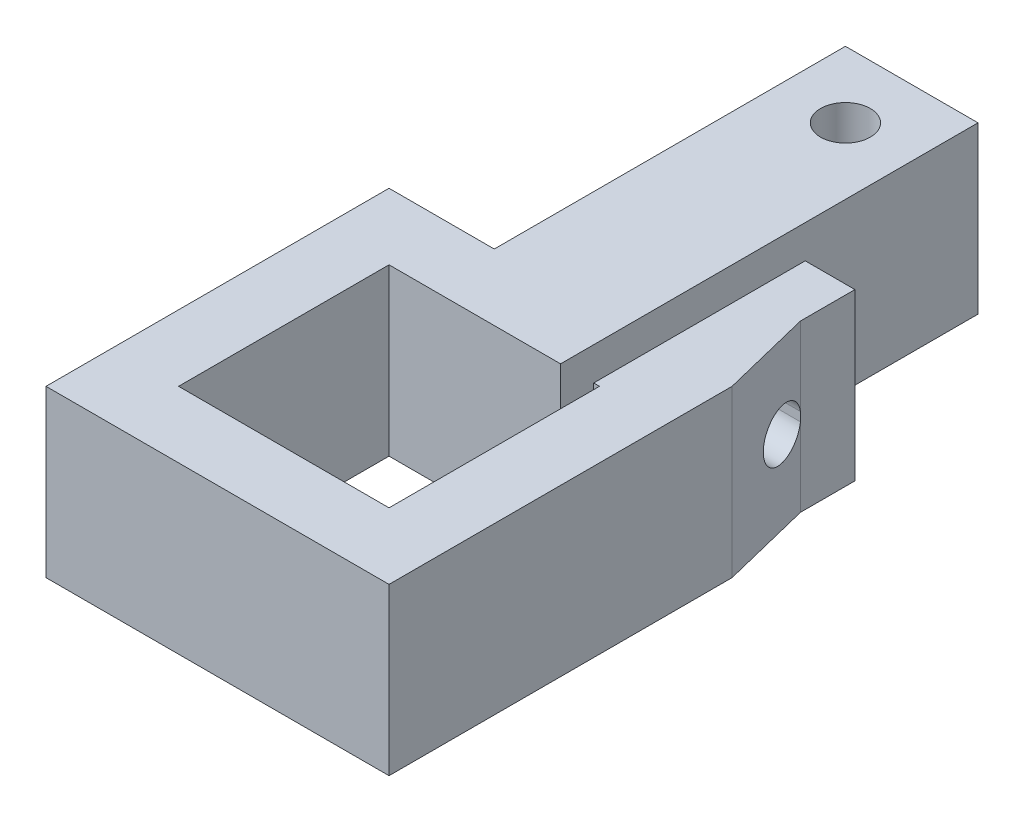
ISO-10303-21;
HEADER;
FILE_DESCRIPTION(('STEP AP214'),'2;1');
FILE_NAME('part.step','',(''),(''),'','','');
FILE_SCHEMA(('AUTOMOTIVE_DESIGN { 1 0 10303 214 1 1 1 1 }'));
ENDSEC;
DATA;
#1=APPLICATION_CONTEXT('core data for automotive mechanical design processes');
#2=APPLICATION_PROTOCOL_DEFINITION('international standard','automotive_design',2000,#1);
#3=PRODUCT_CONTEXT('',#1,'mechanical');
#4=PRODUCT('Part','Part','',(#3));
#5=PRODUCT_RELATED_PRODUCT_CATEGORY('part','',(#4));
#6=PRODUCT_DEFINITION_FORMATION('','',#4);
#7=PRODUCT_DEFINITION_CONTEXT('part definition',#1,'design');
#8=PRODUCT_DEFINITION('design','',#6,#7);
#9=PRODUCT_DEFINITION_SHAPE('','',#8);
#10=(LENGTH_UNIT() NAMED_UNIT(*) SI_UNIT(.MILLI.,.METRE.));
#11=(NAMED_UNIT(*) PLANE_ANGLE_UNIT() SI_UNIT($,.RADIAN.));
#12=(NAMED_UNIT(*) SI_UNIT($,.STERADIAN.) SOLID_ANGLE_UNIT());
#13=UNCERTAINTY_MEASURE_WITH_UNIT(LENGTH_MEASURE(1.E-05),#10,'distance_accuracy_value','');
#14=(GEOMETRIC_REPRESENTATION_CONTEXT(3) GLOBAL_UNCERTAINTY_ASSIGNED_CONTEXT((#13)) GLOBAL_UNIT_ASSIGNED_CONTEXT((#10,
#11,#12)) REPRESENTATION_CONTEXT('',''));
#15=CARTESIAN_POINT('',(0.,0.,0.));
#16=DIRECTION('',(0.,0.,1.));
#17=DIRECTION('',(1.,0.,0.));
#18=AXIS2_PLACEMENT_3D('',#15,#16,#17);
#19=CARTESIAN_POINT('',(1.,10.,0.));
#20=DIRECTION('',(-1.,0.,0.));
#21=DIRECTION('',(0.,0.,1.));
#22=AXIS2_PLACEMENT_3D('',#19,#20,#21);
#23=PLANE('',#22);
#24=DIRECTION('',(0.,0.,-1.));
#25=VECTOR('',#24,1.);
#26=CARTESIAN_POINT('',(1.,0.,0.));
#27=LINE('',#26,#25);
#28=CARTESIAN_POINT('',(1.,0.,-5.88729425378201));
#29=VERTEX_POINT('',#28);
#30=CARTESIAN_POINT('',(1.,0.,-18.6508880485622));
#31=VERTEX_POINT('',#30);
#32=EDGE_CURVE('E252',#29,#31,#27,.T.);
#33=ORIENTED_EDGE('',*,*,#32,.F.);
#34=DIRECTION('',(0.,-1.,0.));
#35=VECTOR('',#34,1.);
#36=CARTESIAN_POINT('',(1.,10.,-5.88729425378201));
#37=LINE('',#36,#35);
#38=CARTESIAN_POINT('',(1.,10.,-5.88729425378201));
#39=VERTEX_POINT('',#38);
#40=EDGE_CURVE('E11',#39,#29,#37,.T.);
#41=ORIENTED_EDGE('',*,*,#40,.F.);
#42=DIRECTION('',(0.,0.,-1.));
#43=VECTOR('',#42,1.);
#44=CARTESIAN_POINT('',(1.,10.,0.));
#45=LINE('',#44,#43);
#46=CARTESIAN_POINT('',(1.,10.,-18.6508880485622));
#47=VERTEX_POINT('',#46);
#48=EDGE_CURVE('E214',#39,#47,#45,.T.);
#49=ORIENTED_EDGE('',*,*,#48,.T.);
#50=DIRECTION('',(0.,-1.,0.));
#51=VECTOR('',#50,1.);
#52=CARTESIAN_POINT('',(1.,10.,-18.6508880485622));
#53=LINE('',#52,#51);
#54=EDGE_CURVE('E204',#47,#31,#53,.T.);
#55=ORIENTED_EDGE('',*,*,#54,.T.);
#56=EDGE_LOOP('',(#33,#41,#49,#55));
#57=FACE_BOUND('',#56,.T.);
#58=DIRECTION('',(0.,-1.,0.));
#59=VECTOR('',#58,1.);
#60=CARTESIAN_POINT('',(1.,10.,-15.3628000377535));
#61=LINE('',#60,#59);
#62=CARTESIAN_POINT('',(1.,5.26996792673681,-15.3628000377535));
#63=VERTEX_POINT('',#62);
#64=CARTESIAN_POINT('',(1.,4.73003207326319,-15.3628000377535));
#65=VERTEX_POINT('',#64);
#66=EDGE_CURVE('E255',#63,#65,#61,.T.);
#67=ORIENTED_EDGE('',*,*,#66,.F.);
#68=CARTESIAN_POINT('',(1.,5.,-13.887294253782));
#69=DIRECTION('',(-1.,0.,0.));
#70=DIRECTION('',(0.,0.,1.));
#71=AXIS2_PLACEMENT_3D('',#68,#69,#70);
#72=CIRCLE('',#71,1.5);
#73=EDGE_CURVE('E185',#63,#65,#72,.F.);
#74=ORIENTED_EDGE('',*,*,#73,.T.);
#75=EDGE_LOOP('',(#67,#74));
#76=FACE_BOUND('',#75,.T.);
#77=ADVANCED_FACE('F35',(#57,#76),#23,.T.);
#78=CARTESIAN_POINT('',(-0.999999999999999,10.,0.));
#79=DIRECTION('',(1.,0.,0.));
#80=DIRECTION('',(0.,0.,-1.));
#81=AXIS2_PLACEMENT_3D('',#78,#79,#80);
#82=PLANE('',#81);
#83=DIRECTION('',(0.,0.,1.));
#84=VECTOR('',#83,1.);
#85=CARTESIAN_POINT('',(-0.999999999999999,0.,0.));
#86=LINE('',#85,#84);
#87=CARTESIAN_POINT('',(-1.,0.,-31.077294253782));
#88=VERTEX_POINT('',#87);
#89=CARTESIAN_POINT('',(-1.,0.,-5.88729425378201));
#90=VERTEX_POINT('',#89);
#91=EDGE_CURVE('E237',#88,#90,#86,.T.);
#92=ORIENTED_EDGE('',*,*,#91,.F.);
#93=DIRECTION('',(0.,-1.,0.));
#94=VECTOR('',#93,1.);
#95=CARTESIAN_POINT('',(-1.,10.,-31.077294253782));
#96=LINE('',#95,#94);
#97=CARTESIAN_POINT('',(-1.,10.,-31.077294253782));
#98=VERTEX_POINT('',#97);
#99=EDGE_CURVE('E363',#98,#88,#96,.T.);
#100=ORIENTED_EDGE('',*,*,#99,.F.);
#101=DIRECTION('',(0.,0.,1.));
#102=VECTOR('',#101,1.);
#103=CARTESIAN_POINT('',(-0.999999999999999,10.,0.));
#104=LINE('',#103,#102);
#105=CARTESIAN_POINT('',(-1.,10.,-5.88729425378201));
#106=VERTEX_POINT('',#105);
#107=EDGE_CURVE('E274',#98,#106,#104,.T.);
#108=ORIENTED_EDGE('',*,*,#107,.T.);
#109=DIRECTION('',(0.,-1.,0.));
#110=VECTOR('',#109,1.);
#111=CARTESIAN_POINT('',(-1.,10.,-5.88729425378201));
#112=LINE('',#111,#110);
#113=EDGE_CURVE('E358',#106,#90,#112,.T.);
#114=ORIENTED_EDGE('',*,*,#113,.T.);
#115=EDGE_LOOP('',(#92,#100,#108,#114));
#116=FACE_BOUND('',#115,.T.);
#117=DIRECTION('',(0.,1.,0.));
#118=VECTOR('',#117,1.);
#119=CARTESIAN_POINT('',(-1.,10.,-15.3628000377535));
#120=LINE('',#119,#118);
#121=CARTESIAN_POINT('',(-1.,4.73003207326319,-15.3628000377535));
#122=VERTEX_POINT('',#121);
#123=CARTESIAN_POINT('',(-1.,5.26996792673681,-15.3628000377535));
#124=VERTEX_POINT('',#123);
#125=EDGE_CURVE('E291',#122,#124,#120,.T.);
#126=ORIENTED_EDGE('',*,*,#125,.F.);
#127=CARTESIAN_POINT('',(-1.,5.,-13.887294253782));
#128=DIRECTION('',(1.,0.,0.));
#129=DIRECTION('',(0.,0.,-1.));
#130=AXIS2_PLACEMENT_3D('',#127,#128,#129);
#131=CIRCLE('',#130,1.5);
#132=EDGE_CURVE('E297',#122,#124,#131,.F.);
#133=ORIENTED_EDGE('',*,*,#132,.T.);
#134=EDGE_LOOP('',(#126,#133));
#135=FACE_BOUND('',#134,.T.);
#136=ADVANCED_FACE('F365',(#116,#135),#82,.T.);
#137=CARTESIAN_POINT('',(-9.00000000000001,10.,0.));
#138=DIRECTION('',(1.,0.,0.));
#139=DIRECTION('',(0.,0.,-1.));
#140=AXIS2_PLACEMENT_3D('',#137,#138,#139);
#141=PLANE('',#140);
#142=DIRECTION('',(0.,0.,1.));
#143=VECTOR('',#142,1.);
#144=CARTESIAN_POINT('',(-9.00000000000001,0.,0.));
#145=LINE('',#144,#143);
#146=CARTESIAN_POINT('',(-9.,0.,-31.077294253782));
#147=VERTEX_POINT('',#146);
#148=CARTESIAN_POINT('',(-9.,0.,-9.88729425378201));
#149=VERTEX_POINT('',#148);
#150=EDGE_CURVE('E232',#147,#149,#145,.T.);
#151=ORIENTED_EDGE('',*,*,#150,.T.);
#152=DIRECTION('',(0.,-1.,0.));
#153=VECTOR('',#152,1.);
#154=CARTESIAN_POINT('',(-9.,10.,-9.88729425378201));
#155=LINE('',#154,#153);
#156=CARTESIAN_POINT('',(-9.,10.,-9.88729425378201));
#157=VERTEX_POINT('',#156);
#158=EDGE_CURVE('E379',#157,#149,#155,.T.);
#159=ORIENTED_EDGE('',*,*,#158,.F.);
#160=DIRECTION('',(0.,0.,1.));
#161=VECTOR('',#160,1.);
#162=CARTESIAN_POINT('',(-9.00000000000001,10.,0.));
#163=LINE('',#162,#161);
#164=CARTESIAN_POINT('',(-9.,10.,-31.077294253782));
#165=VERTEX_POINT('',#164);
#166=EDGE_CURVE('E270',#165,#157,#163,.T.);
#167=ORIENTED_EDGE('',*,*,#166,.F.);
#168=DIRECTION('',(0.,-1.,0.));
#169=VECTOR('',#168,1.);
#170=CARTESIAN_POINT('',(-9.,10.,-31.077294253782));
#171=LINE('',#170,#169);
#172=EDGE_CURVE('E370',#165,#147,#171,.T.);
#173=ORIENTED_EDGE('',*,*,#172,.T.);
#174=EDGE_LOOP('',(#151,#159,#167,#173));
#175=FACE_BOUND('',#174,.T.);
#176=CARTESIAN_POINT('',(-9.,5.,-13.887294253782));
#177=DIRECTION('',(1.,0.,0.));
#178=DIRECTION('',(0.,0.,-1.));
#179=AXIS2_PLACEMENT_3D('',#176,#177,#178);
#180=CIRCLE('',#179,1.5);
#181=CARTESIAN_POINT('',(-9.,4.73003207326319,-15.3628000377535));
#182=VERTEX_POINT('',#181);
#183=CARTESIAN_POINT('',(-9.,5.26996792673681,-15.3628000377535));
#184=VERTEX_POINT('',#183);
#185=EDGE_CURVE('E192',#182,#184,#180,.F.);
#186=ORIENTED_EDGE('',*,*,#185,.F.);
#187=DIRECTION('',(0.,1.,0.));
#188=VECTOR('',#187,1.);
#189=CARTESIAN_POINT('',(-9.,10.,-15.3628000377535));
#190=LINE('',#189,#188);
#191=EDGE_CURVE('E293',#182,#184,#190,.T.);
#192=ORIENTED_EDGE('',*,*,#191,.T.);
#193=EDGE_LOOP('',(#186,#192));
#194=FACE_BOUND('',#193,.T.);
#195=ADVANCED_FACE('F380',(#175,#194),#141,.F.);
#196=CARTESIAN_POINT('',(0.,10.,-5.88729425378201));
#197=DIRECTION('',(0.,0.,-1.));
#198=DIRECTION('',(-1.,0.,0.));
#199=AXIS2_PLACEMENT_3D('',#196,#197,#198);
#200=PLANE('',#199);
#201=DIRECTION('',(1.,0.,0.));
#202=VECTOR('',#201,1.);
#203=CARTESIAN_POINT('',(0.,0.,-5.88729425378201));
#204=LINE('',#203,#202);
#205=CARTESIAN_POINT('',(1.35,0.,-5.88729425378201));
#206=VERTEX_POINT('',#205);
#207=EDGE_CURVE('E249',#29,#206,#204,.T.);
#208=ORIENTED_EDGE('',*,*,#207,.T.);
#209=DIRECTION('',(0.,-1.,0.));
#210=VECTOR('',#209,1.);
#211=CARTESIAN_POINT('',(1.35,10.,-5.88729425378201));
#212=LINE('',#211,#210);
#213=CARTESIAN_POINT('',(1.35,10.,-5.88729425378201));
#214=VERTEX_POINT('',#213);
#215=EDGE_CURVE('E42',#214,#206,#212,.T.);
#216=ORIENTED_EDGE('',*,*,#215,.F.);
#217=DIRECTION('',(1.,0.,0.));
#218=VECTOR('',#217,1.);
#219=CARTESIAN_POINT('',(0.,10.,-5.88729425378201));
#220=LINE('',#219,#218);
#221=EDGE_CURVE('E286',#39,#214,#220,.T.);
#222=ORIENTED_EDGE('',*,*,#221,.F.);
#223=ORIENTED_EDGE('',*,*,#40,.T.);
#224=EDGE_LOOP('',(#208,#216,#222,#223));
#225=FACE_BOUND('',#224,.T.);
#226=ADVANCED_FACE('F335',(#225),#200,.F.);
#227=CARTESIAN_POINT('',(1.35,10.,0.));
#228=DIRECTION('',(-1.,0.,0.));
#229=DIRECTION('',(0.,0.,1.));
#230=AXIS2_PLACEMENT_3D('',#227,#228,#229);
#231=PLANE('',#230);
#232=DIRECTION('',(0.,0.,-1.));
#233=VECTOR('',#232,1.);
#234=CARTESIAN_POINT('',(1.35,0.,0.));
#235=LINE('',#234,#233);
#236=CARTESIAN_POINT('',(1.35,0.,6.81270574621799));
#237=VERTEX_POINT('',#236);
#238=EDGE_CURVE('E246',#237,#206,#235,.T.);
#239=ORIENTED_EDGE('',*,*,#238,.F.);
#240=DIRECTION('',(0.,-1.,0.));
#241=VECTOR('',#240,1.);
#242=CARTESIAN_POINT('',(1.35,10.,6.81270574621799));
#243=LINE('',#242,#241);
#244=CARTESIAN_POINT('',(1.35,10.,6.81270574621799));
#245=VERTEX_POINT('',#244);
#246=EDGE_CURVE('E338',#245,#237,#243,.T.);
#247=ORIENTED_EDGE('',*,*,#246,.F.);
#248=DIRECTION('',(0.,0.,-1.));
#249=VECTOR('',#248,1.);
#250=CARTESIAN_POINT('',(1.35,10.,0.));
#251=LINE('',#250,#249);
#252=EDGE_CURVE('E283',#245,#214,#251,.T.);
#253=ORIENTED_EDGE('',*,*,#252,.T.);
#254=ORIENTED_EDGE('',*,*,#215,.T.);
#255=EDGE_LOOP('',(#239,#247,#253,#254));
#256=FACE_BOUND('',#255,.T.);
#257=ADVANCED_FACE('F339',(#256),#231,.T.);
#258=CARTESIAN_POINT('',(0.,10.,6.81270574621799));
#259=DIRECTION('',(0.,0.,-1.));
#260=DIRECTION('',(-1.,0.,0.));
#261=AXIS2_PLACEMENT_3D('',#258,#259,#260);
#262=PLANE('',#261);
#263=DIRECTION('',(1.,0.,0.));
#264=VECTOR('',#263,1.);
#265=CARTESIAN_POINT('',(0.,0.,6.81270574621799));
#266=LINE('',#265,#264);
#267=CARTESIAN_POINT('',(-11.35,0.,6.81270574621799));
#268=VERTEX_POINT('',#267);
#269=EDGE_CURVE('E243',#268,#237,#266,.T.);
#270=ORIENTED_EDGE('',*,*,#269,.F.);
#271=DIRECTION('',(0.,-1.,0.));
#272=VECTOR('',#271,1.);
#273=CARTESIAN_POINT('',(-11.35,10.,6.81270574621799));
#274=LINE('',#273,#272);
#275=CARTESIAN_POINT('',(-11.35,10.,6.81270574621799));
#276=VERTEX_POINT('',#275);
#277=EDGE_CURVE('E344',#276,#268,#274,.T.);
#278=ORIENTED_EDGE('',*,*,#277,.F.);
#279=DIRECTION('',(1.,0.,0.));
#280=VECTOR('',#279,1.);
#281=CARTESIAN_POINT('',(0.,10.,6.81270574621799));
#282=LINE('',#281,#280);
#283=EDGE_CURVE('E280',#276,#245,#282,.T.);
#284=ORIENTED_EDGE('',*,*,#283,.T.);
#285=ORIENTED_EDGE('',*,*,#246,.T.);
#286=EDGE_LOOP('',(#270,#278,#284,#285));
#287=FACE_BOUND('',#286,.T.);
#288=ADVANCED_FACE('F343',(#287),#262,.T.);
#289=CARTESIAN_POINT('',(-11.35,10.,0.));
#290=DIRECTION('',(-1.,0.,0.));
#291=DIRECTION('',(0.,0.,1.));
#292=AXIS2_PLACEMENT_3D('',#289,#290,#291);
#293=PLANE('',#292);
#294=DIRECTION('',(0.,0.,-1.));
#295=VECTOR('',#294,1.);
#296=CARTESIAN_POINT('',(-11.35,0.,0.));
#297=LINE('',#296,#295);
#298=CARTESIAN_POINT('',(-11.35,0.,-5.88729425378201));
#299=VERTEX_POINT('',#298);
#300=EDGE_CURVE('E241',#268,#299,#297,.T.);
#301=ORIENTED_EDGE('',*,*,#300,.T.);
#302=DIRECTION('',(0.,-1.,0.));
#303=VECTOR('',#302,1.);
#304=CARTESIAN_POINT('',(-11.35,10.,-5.88729425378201));
#305=LINE('',#304,#303);
#306=CARTESIAN_POINT('',(-11.35,10.,-5.88729425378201));
#307=VERTEX_POINT('',#306);
#308=EDGE_CURVE('E348',#307,#299,#305,.T.);
#309=ORIENTED_EDGE('',*,*,#308,.F.);
#310=DIRECTION('',(0.,0.,-1.));
#311=VECTOR('',#310,1.);
#312=CARTESIAN_POINT('',(-11.35,10.,0.));
#313=LINE('',#312,#311);
#314=EDGE_CURVE('E278',#276,#307,#313,.T.);
#315=ORIENTED_EDGE('',*,*,#314,.F.);
#316=ORIENTED_EDGE('',*,*,#277,.T.);
#317=EDGE_LOOP('',(#301,#309,#315,#316));
#318=FACE_BOUND('',#317,.T.);
#319=ADVANCED_FACE('F351',(#318),#293,.F.);
#320=EDGE_CURVE('E240',#299,#90,#204,.T.);
#321=ORIENTED_EDGE('',*,*,#320,.T.);
#322=ORIENTED_EDGE('',*,*,#113,.F.);
#323=EDGE_CURVE('E277',#307,#106,#220,.T.);
#324=ORIENTED_EDGE('',*,*,#323,.F.);
#325=ORIENTED_EDGE('',*,*,#308,.T.);
#326=EDGE_LOOP('',(#321,#322,#324,#325));
#327=FACE_BOUND('',#326,.T.);
#328=ADVANCED_FACE('F359',(#327),#200,.F.);
#329=CARTESIAN_POINT('',(0.,10.,-31.077294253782));
#330=DIRECTION('',(0.,0.,1.));
#331=DIRECTION('',(1.,0.,0.));
#332=AXIS2_PLACEMENT_3D('',#329,#330,#331);
#333=PLANE('',#332);
#334=DIRECTION('',(-1.,0.,0.));
#335=VECTOR('',#334,1.);
#336=CARTESIAN_POINT('',(0.,0.,-31.077294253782));
#337=LINE('',#336,#335);
#338=EDGE_CURVE('E235',#88,#147,#337,.T.);
#339=ORIENTED_EDGE('',*,*,#338,.T.);
#340=ORIENTED_EDGE('',*,*,#172,.F.);
#341=DIRECTION('',(-1.,0.,0.));
#342=VECTOR('',#341,1.);
#343=CARTESIAN_POINT('',(0.,10.,-31.077294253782));
#344=LINE('',#343,#342);
#345=EDGE_CURVE('E272',#98,#165,#344,.T.);
#346=ORIENTED_EDGE('',*,*,#345,.F.);
#347=ORIENTED_EDGE('',*,*,#99,.T.);
#348=EDGE_LOOP('',(#339,#340,#346,#347));
#349=FACE_BOUND('',#348,.T.);
#350=ADVANCED_FACE('F373',(#349),#333,.F.);
#351=CARTESIAN_POINT('',(0.,10.,-9.88729425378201));
#352=DIRECTION('',(0.,0.,-1.));
#353=DIRECTION('',(-1.,0.,0.));
#354=AXIS2_PLACEMENT_3D('',#351,#352,#353);
#355=PLANE('',#354);
#356=DIRECTION('',(1.,0.,0.));
#357=VECTOR('',#356,1.);
#358=CARTESIAN_POINT('',(0.,0.,-9.88729425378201));
#359=LINE('',#358,#357);
#360=CARTESIAN_POINT('',(-15.35,0.,-9.88729425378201));
#361=VERTEX_POINT('',#360);
#362=EDGE_CURVE('E229',#361,#149,#359,.T.);
#363=ORIENTED_EDGE('',*,*,#362,.F.);
#364=DIRECTION('',(0.,-1.,0.));
#365=VECTOR('',#364,1.);
#366=CARTESIAN_POINT('',(-15.35,10.,-9.88729425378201));
#367=LINE('',#366,#365);
#368=CARTESIAN_POINT('',(-15.35,10.,-9.88729425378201));
#369=VERTEX_POINT('',#368);
#370=EDGE_CURVE('E385',#369,#361,#367,.T.);
#371=ORIENTED_EDGE('',*,*,#370,.F.);
#372=DIRECTION('',(1.,0.,0.));
#373=VECTOR('',#372,1.);
#374=CARTESIAN_POINT('',(0.,10.,-9.88729425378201));
#375=LINE('',#374,#373);
#376=EDGE_CURVE('E267',#369,#157,#375,.T.);
#377=ORIENTED_EDGE('',*,*,#376,.T.);
#378=ORIENTED_EDGE('',*,*,#158,.T.);
#379=EDGE_LOOP('',(#363,#371,#377,#378));
#380=FACE_BOUND('',#379,.T.);
#381=ADVANCED_FACE('F387',(#380),#355,.T.);
#382=CARTESIAN_POINT('',(-15.35,10.,0.));
#383=DIRECTION('',(1.,0.,0.));
#384=DIRECTION('',(0.,0.,-1.));
#385=AXIS2_PLACEMENT_3D('',#382,#383,#384);
#386=PLANE('',#385);
#387=DIRECTION('',(0.,0.,1.));
#388=VECTOR('',#387,1.);
#389=CARTESIAN_POINT('',(-15.35,0.,0.));
#390=LINE('',#389,#388);
#391=CARTESIAN_POINT('',(-15.35,0.,10.812705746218));
#392=VERTEX_POINT('',#391);
#393=EDGE_CURVE('E227',#361,#392,#390,.T.);
#394=ORIENTED_EDGE('',*,*,#393,.T.);
#395=DIRECTION('',(0.,-1.,0.));
#396=VECTOR('',#395,1.);
#397=CARTESIAN_POINT('',(-15.35,10.,10.812705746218));
#398=LINE('',#397,#396);
#399=CARTESIAN_POINT('',(-15.35,10.,10.812705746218));
#400=VERTEX_POINT('',#399);
#401=EDGE_CURVE('E391',#400,#392,#398,.T.);
#402=ORIENTED_EDGE('',*,*,#401,.F.);
#403=DIRECTION('',(0.,0.,1.));
#404=VECTOR('',#403,1.);
#405=CARTESIAN_POINT('',(-15.35,10.,0.));
#406=LINE('',#405,#404);
#407=EDGE_CURVE('E265',#369,#400,#406,.T.);
#408=ORIENTED_EDGE('',*,*,#407,.F.);
#409=ORIENTED_EDGE('',*,*,#370,.T.);
#410=EDGE_LOOP('',(#394,#402,#408,#409));
#411=FACE_BOUND('',#410,.T.);
#412=ADVANCED_FACE('F394',(#411),#386,.F.);
#413=CARTESIAN_POINT('',(0.,10.,10.812705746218));
#414=DIRECTION('',(0.,0.,-1.));
#415=DIRECTION('',(-1.,0.,0.));
#416=AXIS2_PLACEMENT_3D('',#413,#414,#415);
#417=PLANE('',#416);
#418=DIRECTION('',(1.,0.,0.));
#419=VECTOR('',#418,1.);
#420=CARTESIAN_POINT('',(0.,0.,10.812705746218));
#421=LINE('',#420,#419);
#422=CARTESIAN_POINT('',(5.35,0.,10.812705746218));
#423=VERTEX_POINT('',#422);
#424=EDGE_CURVE('E224',#392,#423,#421,.T.);
#425=ORIENTED_EDGE('',*,*,#424,.T.);
#426=DIRECTION('',(0.,-1.,0.));
#427=VECTOR('',#426,1.);
#428=CARTESIAN_POINT('',(5.35,10.,10.812705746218));
#429=LINE('',#428,#427);
#430=CARTESIAN_POINT('',(5.35,10.,10.812705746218));
#431=VERTEX_POINT('',#430);
#432=EDGE_CURVE('E200',#431,#423,#429,.T.);
#433=ORIENTED_EDGE('',*,*,#432,.F.);
#434=DIRECTION('',(1.,0.,0.));
#435=VECTOR('',#434,1.);
#436=CARTESIAN_POINT('',(0.,10.,10.812705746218));
#437=LINE('',#436,#435);
#438=EDGE_CURVE('E263',#400,#431,#437,.T.);
#439=ORIENTED_EDGE('',*,*,#438,.F.);
#440=ORIENTED_EDGE('',*,*,#401,.T.);
#441=EDGE_LOOP('',(#425,#433,#439,#440));
#442=FACE_BOUND('',#441,.T.);
#443=ADVANCED_FACE('F400',(#442),#417,.F.);
#444=CARTESIAN_POINT('',(5.35,10.,0.));
#445=DIRECTION('',(1.,0.,0.));
#446=DIRECTION('',(0.,0.,-1.));
#447=AXIS2_PLACEMENT_3D('',#444,#445,#446);
#448=PLANE('',#447);
#449=DIRECTION('',(0.,0.,1.));
#450=VECTOR('',#449,1.);
#451=CARTESIAN_POINT('',(5.35,0.,0.));
#452=LINE('',#451,#450);
#453=CARTESIAN_POINT('',(5.35,0.,-9.88729425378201));
#454=VERTEX_POINT('',#453);
#455=EDGE_CURVE('E221',#454,#423,#452,.T.);
#456=ORIENTED_EDGE('',*,*,#455,.F.);
#457=DIRECTION('',(0.,-1.,0.));
#458=VECTOR('',#457,1.);
#459=CARTESIAN_POINT('',(5.35,10.,-9.88729425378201));
#460=LINE('',#459,#458);
#461=CARTESIAN_POINT('',(5.35,10.,-9.88729425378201));
#462=VERTEX_POINT('',#461);
#463=EDGE_CURVE('E199',#462,#454,#460,.T.);
#464=ORIENTED_EDGE('',*,*,#463,.F.);
#465=DIRECTION('',(0.,0.,1.));
#466=VECTOR('',#465,1.);
#467=CARTESIAN_POINT('',(5.35,10.,0.));
#468=LINE('',#467,#466);
#469=EDGE_CURVE('E260',#462,#431,#468,.T.);
#470=ORIENTED_EDGE('',*,*,#469,.T.);
#471=ORIENTED_EDGE('',*,*,#432,.T.);
#472=EDGE_LOOP('',(#456,#464,#470,#471));
#473=FACE_BOUND('',#472,.T.);
#474=ADVANCED_FACE('F405',(#473),#448,.T.);
#475=CARTESIAN_POINT('',(7.34146364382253,10.,-1.81005669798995));
#476=DIRECTION('',(0.970924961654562,0.,-0.239384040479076));
#477=DIRECTION('',(-0.239384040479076,0.,-0.970924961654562));
#478=AXIS2_PLACEMENT_3D('',#475,#476,#477);
#479=PLANE('',#478);
#480=DIRECTION('',(0.,-1.,0.));
#481=VECTOR('',#480,1.);
#482=CARTESIAN_POINT('',(4.,10.,-15.3628000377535));
#483=LINE('',#482,#481);
#484=CARTESIAN_POINT('',(4.,4.73003207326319,-15.3628000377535));
#485=VERTEX_POINT('',#484);
#486=CARTESIAN_POINT('',(4.,0.,-15.3628000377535));
#487=VERTEX_POINT('',#486);
#488=EDGE_CURVE('E178',#485,#487,#483,.T.);
#489=ORIENTED_EDGE('',*,*,#488,.F.);
#490=CARTESIAN_POINT('',(4.36378973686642,5.,-13.887294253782));
#491=DIRECTION('',(0.970924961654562,0.,-0.239384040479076));
#492=DIRECTION('',(-0.239384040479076,0.,-0.970924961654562));
#493=AXIS2_PLACEMENT_3D('',#490,#491,#492);
#494=ELLIPSE('',#493,1.54491856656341,1.5);
#495=CARTESIAN_POINT('',(4.,5.26996792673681,-15.3628000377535));
#496=VERTEX_POINT('',#495);
#497=EDGE_CURVE('E182',#485,#496,#494,.F.);
#498=ORIENTED_EDGE('',*,*,#497,.T.);
#499=CARTESIAN_POINT('',(4.,10.,-15.3628000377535));
#500=VERTEX_POINT('',#499);
#501=EDGE_CURVE('E177',#500,#496,#483,.T.);
#502=ORIENTED_EDGE('',*,*,#501,.F.);
#503=DIRECTION('',(0.239384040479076,0.,0.970924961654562));
#504=VECTOR('',#503,1.);
#505=CARTESIAN_POINT('',(7.34146364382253,10.,-1.81005669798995));
#506=LINE('',#505,#504);
#507=EDGE_CURVE('E258',#500,#462,#506,.T.);
#508=ORIENTED_EDGE('',*,*,#507,.T.);
#509=ORIENTED_EDGE('',*,*,#463,.T.);
#510=DIRECTION('',(0.239384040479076,0.,0.970924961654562));
#511=VECTOR('',#510,1.);
#512=CARTESIAN_POINT('',(7.34146364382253,0.,-1.81005669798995));
#513=LINE('',#512,#511);
#514=EDGE_CURVE('E218',#487,#454,#513,.T.);
#515=ORIENTED_EDGE('',*,*,#514,.F.);
#516=EDGE_LOOP('',(#489,#498,#502,#508,#509,#515));
#517=FACE_BOUND('',#516,.T.);
#518=ADVANCED_FACE('F188',(#517),#479,.T.);
#519=CARTESIAN_POINT('',(4.,10.,0.));
#520=DIRECTION('',(1.,0.,0.));
#521=DIRECTION('',(0.,0.,-1.));
#522=AXIS2_PLACEMENT_3D('',#519,#520,#521);
#523=PLANE('',#522);
#524=DIRECTION('',(0.,0.,1.));
#525=VECTOR('',#524,1.);
#526=CARTESIAN_POINT('',(4.,0.,0.));
#527=LINE('',#526,#525);
#528=CARTESIAN_POINT('',(4.,0.,-18.6508880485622));
#529=VERTEX_POINT('',#528);
#530=EDGE_CURVE('E215',#529,#487,#527,.T.);
#531=ORIENTED_EDGE('',*,*,#530,.F.);
#532=DIRECTION('',(0.,-1.,0.));
#533=VECTOR('',#532,1.);
#534=CARTESIAN_POINT('',(4.,10.,-18.6508880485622));
#535=LINE('',#534,#533);
#536=CARTESIAN_POINT('',(4.,10.,-18.6508880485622));
#537=VERTEX_POINT('',#536);
#538=EDGE_CURVE('E203',#537,#529,#535,.T.);
#539=ORIENTED_EDGE('',*,*,#538,.F.);
#540=DIRECTION('',(0.,0.,1.));
#541=VECTOR('',#540,1.);
#542=CARTESIAN_POINT('',(4.,10.,0.));
#543=LINE('',#542,#541);
#544=EDGE_CURVE('E198',#537,#500,#543,.T.);
#545=ORIENTED_EDGE('',*,*,#544,.T.);
#546=ORIENTED_EDGE('',*,*,#501,.T.);
#547=EDGE_CURVE('E170',#496,#485,#483,.T.);
#548=ORIENTED_EDGE('',*,*,#547,.T.);
#549=ORIENTED_EDGE('',*,*,#488,.T.);
#550=EDGE_LOOP('',(#531,#539,#545,#546,#548,#549));
#551=FACE_BOUND('',#550,.T.);
#552=ADVANCED_FACE('F196',(#551),#523,.T.);
#553=CARTESIAN_POINT('',(0.,10.,-18.6508880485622));
#554=DIRECTION('',(0.,0.,1.));
#555=DIRECTION('',(1.,0.,0.));
#556=AXIS2_PLACEMENT_3D('',#553,#554,#555);
#557=PLANE('',#556);
#558=DIRECTION('',(-1.,0.,0.));
#559=VECTOR('',#558,1.);
#560=CARTESIAN_POINT('',(0.,0.,-18.6508880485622));
#561=LINE('',#560,#559);
#562=EDGE_CURVE('E212',#529,#31,#561,.T.);
#563=ORIENTED_EDGE('',*,*,#562,.T.);
#564=ORIENTED_EDGE('',*,*,#54,.F.);
#565=DIRECTION('',(-1.,0.,0.));
#566=VECTOR('',#565,1.);
#567=CARTESIAN_POINT('',(0.,10.,-18.6508880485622));
#568=LINE('',#567,#566);
#569=EDGE_CURVE('E209',#537,#47,#568,.T.);
#570=ORIENTED_EDGE('',*,*,#569,.F.);
#571=ORIENTED_EDGE('',*,*,#538,.T.);
#572=EDGE_LOOP('',(#563,#564,#570,#571));
#573=FACE_BOUND('',#572,.T.);
#574=ADVANCED_FACE('F323',(#573),#557,.F.);
#575=CARTESIAN_POINT('',(0.,10.,0.));
#576=DIRECTION('',(0.,1.,0.));
#577=DIRECTION('',(0.,0.,1.));
#578=AXIS2_PLACEMENT_3D('',#575,#576,#577);
#579=PLANE('',#578);
#580=CARTESIAN_POINT('',(-5.,10.,-27.077294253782));
#581=DIRECTION('',(0.,1.,0.));
#582=DIRECTION('',(0.,0.,1.));
#583=AXIS2_PLACEMENT_3D('',#580,#581,#582);
#584=CIRCLE('',#583,1.5);
#585=CARTESIAN_POINT('',(-5.,10.,-25.577294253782));
#586=VERTEX_POINT('',#585);
#587=EDGE_CURVE('E304',#586,#586,#584,.T.);
#588=ORIENTED_EDGE('',*,*,#587,.F.);
#589=EDGE_LOOP('',(#588));
#590=FACE_BOUND('',#589,.T.);
#591=ORIENTED_EDGE('',*,*,#48,.F.);
#592=ORIENTED_EDGE('',*,*,#221,.T.);
#593=ORIENTED_EDGE('',*,*,#252,.F.);
#594=ORIENTED_EDGE('',*,*,#283,.F.);
#595=ORIENTED_EDGE('',*,*,#314,.T.);
#596=ORIENTED_EDGE('',*,*,#323,.T.);
#597=ORIENTED_EDGE('',*,*,#107,.F.);
#598=ORIENTED_EDGE('',*,*,#345,.T.);
#599=ORIENTED_EDGE('',*,*,#166,.T.);
#600=ORIENTED_EDGE('',*,*,#376,.F.);
#601=ORIENTED_EDGE('',*,*,#407,.T.);
#602=ORIENTED_EDGE('',*,*,#438,.T.);
#603=ORIENTED_EDGE('',*,*,#469,.F.);
#604=ORIENTED_EDGE('',*,*,#507,.F.);
#605=ORIENTED_EDGE('',*,*,#544,.F.);
#606=ORIENTED_EDGE('',*,*,#569,.T.);
#607=EDGE_LOOP('',(#591,#592,#593,#594,#595,#596,#597,#598,#599,#600,#601,#602,#603,#604,#605,#606));
#608=FACE_BOUND('',#607,.T.);
#609=ADVANCED_FACE('F320',(#590,#608),#579,.T.);
#610=CARTESIAN_POINT('',(0.,0.,0.));
#611=DIRECTION('',(0.,1.,0.));
#612=DIRECTION('',(0.,0.,1.));
#613=AXIS2_PLACEMENT_3D('',#610,#611,#612);
#614=PLANE('',#613);
#615=CARTESIAN_POINT('',(-5.,0.,-27.077294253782));
#616=DIRECTION('',(0.,1.,0.));
#617=DIRECTION('',(0.,0.,1.));
#618=AXIS2_PLACEMENT_3D('',#615,#616,#617);
#619=CIRCLE('',#618,1.5);
#620=CARTESIAN_POINT('',(-5.,0.,-25.577294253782));
#621=VERTEX_POINT('',#620);
#622=EDGE_CURVE('E303',#621,#621,#619,.T.);
#623=ORIENTED_EDGE('',*,*,#622,.T.);
#624=EDGE_LOOP('',(#623));
#625=FACE_BOUND('',#624,.T.);
#626=ORIENTED_EDGE('',*,*,#32,.T.);
#627=ORIENTED_EDGE('',*,*,#562,.F.);
#628=ORIENTED_EDGE('',*,*,#530,.T.);
#629=ORIENTED_EDGE('',*,*,#514,.T.);
#630=ORIENTED_EDGE('',*,*,#455,.T.);
#631=ORIENTED_EDGE('',*,*,#424,.F.);
#632=ORIENTED_EDGE('',*,*,#393,.F.);
#633=ORIENTED_EDGE('',*,*,#362,.T.);
#634=ORIENTED_EDGE('',*,*,#150,.F.);
#635=ORIENTED_EDGE('',*,*,#338,.F.);
#636=ORIENTED_EDGE('',*,*,#91,.T.);
#637=ORIENTED_EDGE('',*,*,#320,.F.);
#638=ORIENTED_EDGE('',*,*,#300,.F.);
#639=ORIENTED_EDGE('',*,*,#269,.T.);
#640=ORIENTED_EDGE('',*,*,#238,.T.);
#641=ORIENTED_EDGE('',*,*,#207,.F.);
#642=EDGE_LOOP('',(#626,#627,#628,#629,#630,#631,#632,#633,#634,#635,#636,#637,#638,#639,#640,#641));
#643=FACE_BOUND('',#642,.T.);
#644=ADVANCED_FACE('F310',(#625,#643),#614,.F.);
#645=CARTESIAN_POINT('',(11.,0.,-15.3628000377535));
#646=DIRECTION('',(0.,0.,-1.));
#647=DIRECTION('',(-1.,0.,0.));
#648=AXIS2_PLACEMENT_3D('',#645,#646,#647);
#649=PLANE('',#648);
#650=ORIENTED_EDGE('',*,*,#66,.T.);
#651=DIRECTION('',(-1.,0.,0.));
#652=VECTOR('',#651,1.);
#653=CARTESIAN_POINT('',(11.,4.73003207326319,-15.3628000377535));
#654=LINE('',#653,#652);
#655=EDGE_CURVE('E49',#485,#65,#654,.T.);
#656=ORIENTED_EDGE('',*,*,#655,.F.);
#657=ORIENTED_EDGE('',*,*,#547,.F.);
#658=DIRECTION('',(-1.,0.,0.));
#659=VECTOR('',#658,1.);
#660=CARTESIAN_POINT('',(11.,5.26996792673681,-15.3628000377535));
#661=LINE('',#660,#659);
#662=EDGE_CURVE('E173',#496,#63,#661,.T.);
#663=ORIENTED_EDGE('',*,*,#662,.T.);
#664=EDGE_LOOP('',(#650,#656,#657,#663));
#665=FACE_BOUND('',#664,.T.);
#666=ADVANCED_FACE('F172',(#665),#649,.F.);
#667=CARTESIAN_POINT('',(11.,5.,-13.887294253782));
#668=DIRECTION('',(-1.,0.,0.));
#669=DIRECTION('',(0.,0.,1.));
#670=AXIS2_PLACEMENT_3D('',#667,#668,#669);
#671=CYLINDRICAL_SURFACE('',#670,1.5);
#672=ORIENTED_EDGE('',*,*,#662,.F.);
#673=ORIENTED_EDGE('',*,*,#497,.F.);
#674=ORIENTED_EDGE('',*,*,#655,.T.);
#675=ORIENTED_EDGE('',*,*,#73,.F.);
#676=EDGE_LOOP('',(#672,#673,#674,#675));
#677=FACE_BOUND('',#676,.T.);
#678=ADVANCED_FACE('F181',(#677),#671,.F.);
#679=ORIENTED_EDGE('',*,*,#125,.T.);
#680=EDGE_CURVE('E57',#124,#184,#661,.T.);
#681=ORIENTED_EDGE('',*,*,#680,.T.);
#682=ORIENTED_EDGE('',*,*,#191,.F.);
#683=EDGE_CURVE('E301',#122,#182,#654,.T.);
#684=ORIENTED_EDGE('',*,*,#683,.F.);
#685=EDGE_LOOP('',(#679,#681,#682,#684));
#686=FACE_BOUND('',#685,.T.);
#687=ADVANCED_FACE('F474',(#686),#649,.F.);
#688=ORIENTED_EDGE('',*,*,#683,.T.);
#689=ORIENTED_EDGE('',*,*,#185,.T.);
#690=ORIENTED_EDGE('',*,*,#680,.F.);
#691=ORIENTED_EDGE('',*,*,#132,.F.);
#692=EDGE_LOOP('',(#688,#689,#690,#691));
#693=FACE_BOUND('',#692,.T.);
#694=ADVANCED_FACE('F316',(#693),#671,.F.);
#695=CARTESIAN_POINT('',(-5.,0.,-27.077294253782));
#696=DIRECTION('',(0.,1.,0.));
#697=DIRECTION('',(0.,0.,1.));
#698=AXIS2_PLACEMENT_3D('',#695,#696,#697);
#699=CYLINDRICAL_SURFACE('',#698,1.5);
#700=ORIENTED_EDGE('',*,*,#622,.F.);
#701=EDGE_LOOP('',(#700));
#702=FACE_BOUND('',#701,.T.);
#703=ORIENTED_EDGE('',*,*,#587,.T.);
#704=EDGE_LOOP('',(#703));
#705=FACE_BOUND('',#704,.T.);
#706=ADVANCED_FACE('F313',(#702,#705),#699,.F.);
#707=CLOSED_SHELL('',(#77,#136,#195,#226,#257,#288,#319,#328,#350,#381,#412,#443,#474,#518,#552,
#574,#609,#644,#666,#678,#687,#694,#706));
#708=MANIFOLD_SOLID_BREP('B2',#707);
#709=ADVANCED_BREP_SHAPE_REPRESENTATION('',(#18,#708),#14);
#710=SHAPE_DEFINITION_REPRESENTATION(#9,#709);
ENDSEC;
END-ISO-10303-21;
